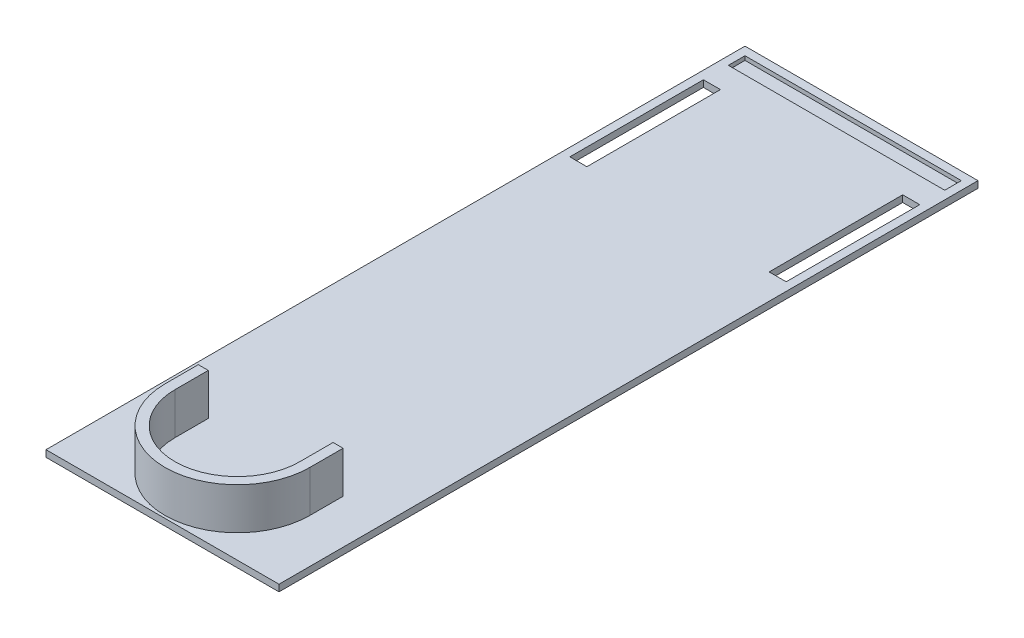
from build123d import *

# Parameters (mm, degrees)
SKETCH2_W           = 140
SKETCH2_H           = 420
BOSS_EXTRUDE1_DEPTH = 4
BOSS_EXTRUDE2_DEPTH = 25
SKETCH4_W           = 10.25
SKETCH4_H           = 80.25
CUT_EXTRUDE1_DEPTH  = 25.4
SKETCH7_W           = 130
SKETCH7_H           = 10
CUT_EXTRUDE2_DEPTH  = 2.45


with BuildPart() as part:
    # Sketch2 → Boss-Extrude1 (new body)
    with BuildSketch(Plane(origin=(0, 0, 0), x_dir=(1, 0, 0), z_dir=(0, 1, 0))):
        Rectangle(SKETCH2_W, SKETCH2_H)
    extrude(amount=BOSS_EXTRUDE1_DEPTH)

    # Sketch3 → Boss-Extrude2 (add)
    with BuildSketch(Plane(origin=(0, 4, 0), x_dir=(1, 0, 0), z_dir=(0, 1, 0))):
        with BuildLine():
            Line((-37.5, -165), (-37.5, -145))
            Line((-37.5, -145), (-43.5, -145))
            Line((-43.5, -145), (-43.5, -165))
            ThreePointArc((-43.5, -165), (0, -208.5), (43.5, -165))
            Line((43.5, -165), (43.5, -145))
            Line((43.5, -145), (37.5, -145))
            Line((37.5, -145), (37.5, -165))
            ThreePointArc((37.5, -165), (0, -202.5), (-37.5, -165))
        make_face()
    extrude(amount=BOSS_EXTRUDE2_DEPTH)

    # Sketch4 → Cut-Extrude1 (cut)
    with BuildSketch(Plane(origin=(0, 4, 0), x_dir=(1, 0, 0), z_dir=(0, 1, 0))):
        with Locations((-59.875, 139.875)):
            Rectangle(SKETCH4_W, SKETCH4_H)
        with Locations((59.875, 139.875)):
            Rectangle(SKETCH4_W, SKETCH4_H)
    extrude(amount=-CUT_EXTRUDE1_DEPTH, mode=Mode.SUBTRACT)

    # Sketch7 → Cut-Extrude2 (cut)
    with BuildSketch(Plane(origin=(0, 4, 0), x_dir=(1, 0, 0), z_dir=(0, 1, 0))):
        with Locations((0, 200)):
            Rectangle(SKETCH7_W, SKETCH7_H)
    extrude(amount=-CUT_EXTRUDE2_DEPTH, mode=Mode.SUBTRACT)


solid = part.part
